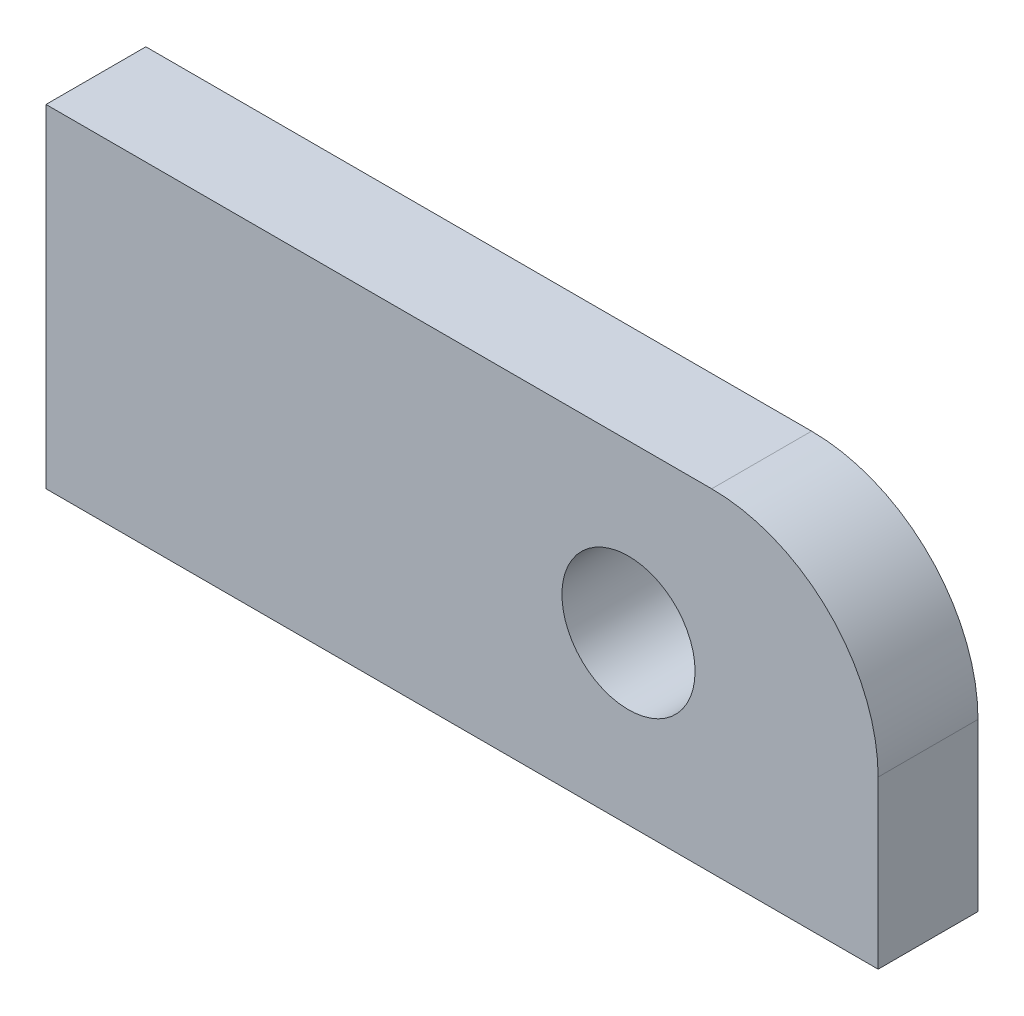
from build123d import *

# Parameters (mm, degrees)
ESQUISSE1_R          = 8
BASE_EXTRUSION_DEPTH = 12


with BuildPart() as part:
    # Esquisse1 → Base-Extrusion (new body)
    with BuildSketch(Plane.XY):
        with BuildLine():
            Line((0, 0), (100, 0))
            Line((100, 0), (100, 20))
            ThreePointArc((100, 20), (94.142135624, 34.142135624), (80, 40))
            Line((80, 40), (0, 40))
            Line((0, 40), (0, 0))
        make_face()
        with Locations((70, 20)):
            Circle(ESQUISSE1_R, mode=Mode.SUBTRACT)
    extrude(amount=BASE_EXTRUSION_DEPTH)


solid = part.part
